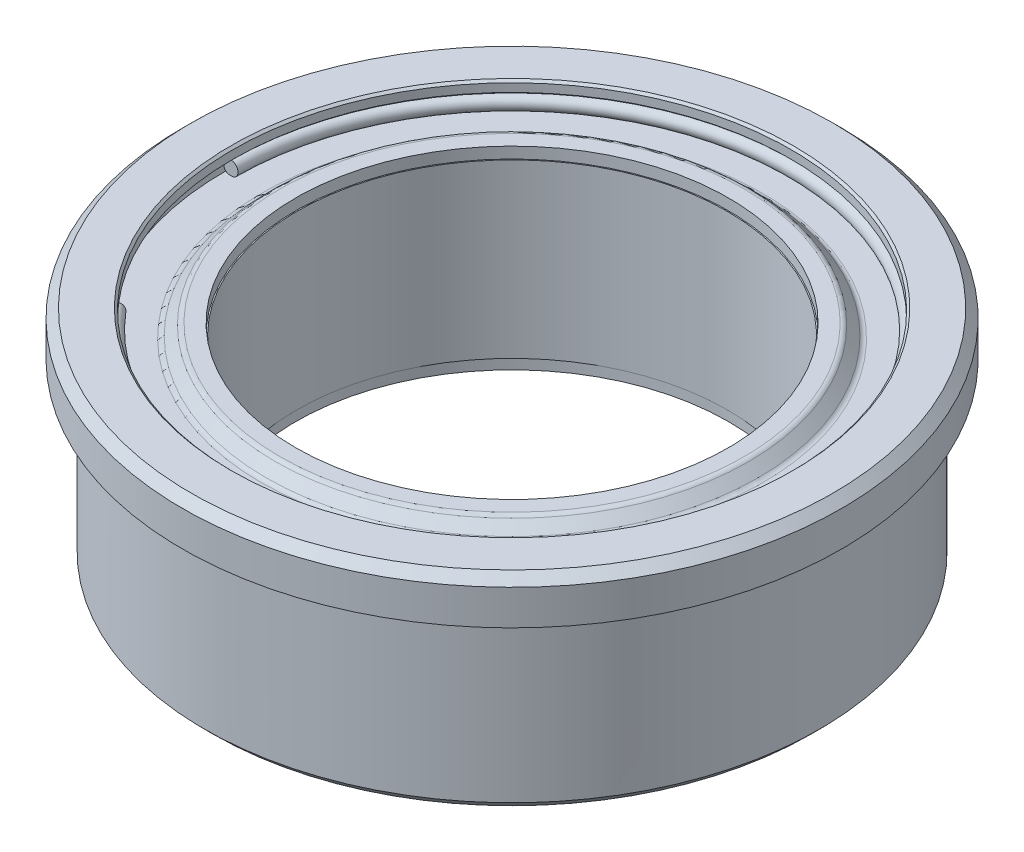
ISO-10303-21;
HEADER;
FILE_DESCRIPTION(('STEP AP214'),'2;1');
FILE_NAME('part.step','',(''),(''),'','','');
FILE_SCHEMA(('AUTOMOTIVE_DESIGN { 1 0 10303 214 1 1 1 1 }'));
ENDSEC;
DATA;
#1=APPLICATION_CONTEXT('core data for automotive mechanical design processes');
#2=APPLICATION_PROTOCOL_DEFINITION('international standard','automotive_design',2000,#1);
#3=PRODUCT_CONTEXT('',#1,'mechanical');
#4=PRODUCT('Part','Part','',(#3));
#5=PRODUCT_RELATED_PRODUCT_CATEGORY('part','',(#4));
#6=PRODUCT_DEFINITION_FORMATION('','',#4);
#7=PRODUCT_DEFINITION_CONTEXT('part definition',#1,'design');
#8=PRODUCT_DEFINITION('design','',#6,#7);
#9=PRODUCT_DEFINITION_SHAPE('','',#8);
#10=(LENGTH_UNIT() NAMED_UNIT(*) SI_UNIT(.MILLI.,.METRE.));
#11=(NAMED_UNIT(*) PLANE_ANGLE_UNIT() SI_UNIT($,.RADIAN.));
#12=(NAMED_UNIT(*) SI_UNIT($,.STERADIAN.) SOLID_ANGLE_UNIT());
#13=UNCERTAINTY_MEASURE_WITH_UNIT(LENGTH_MEASURE(1.E-05),#10,'distance_accuracy_value','');
#14=(GEOMETRIC_REPRESENTATION_CONTEXT(3) GLOBAL_UNCERTAINTY_ASSIGNED_CONTEXT((#13)) GLOBAL_UNIT_ASSIGNED_CONTEXT((#10,
#11,#12)) REPRESENTATION_CONTEXT('',''));
#15=CARTESIAN_POINT('',(0.,0.,0.));
#16=DIRECTION('',(0.,0.,1.));
#17=DIRECTION('',(1.,0.,0.));
#18=AXIS2_PLACEMENT_3D('',#15,#16,#17);
#19=CARTESIAN_POINT('',(0.,4.456,0.));
#20=DIRECTION('',(0.,1.,0.));
#21=DIRECTION('',(0.,0.,1.));
#22=AXIS2_PLACEMENT_3D('',#19,#20,#21);
#23=CYLINDRICAL_SURFACE('',#22,4.925);
#24=CARTESIAN_POINT('',(0.,4.456,0.));
#25=DIRECTION('',(0.,1.,0.));
#26=DIRECTION('',(0.,0.,1.));
#27=AXIS2_PLACEMENT_3D('',#24,#25,#26);
#28=CIRCLE('',#27,4.925);
#29=CARTESIAN_POINT('',(0.,4.456,4.925));
#30=VERTEX_POINT('',#29);
#31=EDGE_CURVE('E997',#30,#30,#28,.T.);
#32=ORIENTED_EDGE('',*,*,#31,.F.);
#33=EDGE_LOOP('',(#32));
#34=FACE_BOUND('',#33,.T.);
#35=CARTESIAN_POINT('',(0.,4.71,0.));
#36=DIRECTION('',(0.,1.,0.));
#37=DIRECTION('',(0.,0.,1.));
#38=AXIS2_PLACEMENT_3D('',#35,#36,#37);
#39=CIRCLE('',#38,4.925);
#40=CARTESIAN_POINT('',(0.,4.71,4.925));
#41=VERTEX_POINT('',#40);
#42=EDGE_CURVE('E1000',#41,#41,#39,.F.);
#43=ORIENTED_EDGE('',*,*,#42,.F.);
#44=EDGE_LOOP('',(#43));
#45=FACE_BOUND('',#44,.T.);
#46=ADVANCED_FACE('F16',(#34,#45),#23,.F.);
#47=CARTESIAN_POINT('',(0.,4.456,0.));
#48=DIRECTION('',(0.,1.,0.));
#49=DIRECTION('',(0.,0.,1.));
#50=AXIS2_PLACEMENT_3D('',#47,#48,#49);
#51=PLANE('',#50);
#52=CARTESIAN_POINT('',(0.,4.456,0.));
#53=DIRECTION('',(0.,-1.,0.));
#54=DIRECTION('',(0.,0.,-1.));
#55=AXIS2_PLACEMENT_3D('',#52,#53,#54);
#56=CIRCLE('',#55,4.9);
#57=CARTESIAN_POINT('',(0.,4.456,-4.9));
#58=VERTEX_POINT('',#57);
#59=EDGE_CURVE('E1001',#58,#58,#56,.T.);
#60=ORIENTED_EDGE('',*,*,#59,.T.);
#61=EDGE_LOOP('',(#60));
#62=FACE_BOUND('',#61,.T.);
#63=ORIENTED_EDGE('',*,*,#31,.T.);
#64=EDGE_LOOP('',(#63));
#65=FACE_BOUND('',#64,.T.);
#66=ADVANCED_FACE('F961',(#62,#65),#51,.T.);
#67=CARTESIAN_POINT('',(0.,4.71,0.));
#68=DIRECTION('',(0.,1.,0.));
#69=DIRECTION('',(0.,0.,1.));
#70=AXIS2_PLACEMENT_3D('',#67,#68,#69);
#71=PLANE('',#70);
#72=ORIENTED_EDGE('',*,*,#42,.T.);
#73=EDGE_LOOP('',(#72));
#74=FACE_BOUND('',#73,.T.);
#75=CARTESIAN_POINT('',(0.,4.71,0.));
#76=DIRECTION('',(0.,-1.,0.));
#77=DIRECTION('',(0.,0.,1.));
#78=AXIS2_PLACEMENT_3D('',#75,#76,#77);
#79=CIRCLE('',#78,5.27978129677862);
#80=CARTESIAN_POINT('',(0.,4.71,5.27978129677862));
#81=VERTEX_POINT('',#80);
#82=EDGE_CURVE('E1004',#81,#81,#79,.T.);
#83=ORIENTED_EDGE('',*,*,#82,.F.);
#84=EDGE_LOOP('',(#83));
#85=FACE_BOUND('',#84,.T.);
#86=ADVANCED_FACE('F953',(#74,#85),#71,.T.);
#87=CARTESIAN_POINT('',(0.,0.3,0.));
#88=DIRECTION('',(0.,-1.,0.));
#89=DIRECTION('',(0.,0.,-1.));
#90=AXIS2_PLACEMENT_3D('',#87,#88,#89);
#91=CYLINDRICAL_SURFACE('',#90,4.9);
#92=ORIENTED_EDGE('',*,*,#59,.F.);
#93=EDGE_LOOP('',(#92));
#94=FACE_BOUND('',#93,.T.);
#95=CARTESIAN_POINT('',(0.,0.544,0.));
#96=DIRECTION('',(0.,-1.,0.));
#97=DIRECTION('',(0.,0.,-1.));
#98=AXIS2_PLACEMENT_3D('',#95,#96,#97);
#99=CIRCLE('',#98,4.9);
#100=CARTESIAN_POINT('',(0.,0.544,-4.9));
#101=VERTEX_POINT('',#100);
#102=EDGE_CURVE('E290',#101,#101,#99,.F.);
#103=ORIENTED_EDGE('',*,*,#102,.F.);
#104=EDGE_LOOP('',(#103));
#105=FACE_BOUND('',#104,.T.);
#106=ADVANCED_FACE('F304',(#94,#105),#91,.F.);
#107=CARTESIAN_POINT('',(0.,4.56,0.));
#108=DIRECTION('',(0.,1.,0.));
#109=DIRECTION('',(0.,0.,1.));
#110=AXIS2_PLACEMENT_3D('',#107,#108,#109);
#111=TOROIDAL_SURFACE('',#110,5.27978129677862,0.15);
#112=CARTESIAN_POINT('',(0.,4.66606601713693,0.));
#113=DIRECTION('',(0.,-1.,0.));
#114=DIRECTION('',(0.,0.,-1.));
#115=AXIS2_PLACEMENT_3D('',#112,#113,#114);
#116=CIRCLE('',#115,5.38584731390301);
#117=CARTESIAN_POINT('',(0.,4.66606601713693,-5.38584731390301));
#118=VERTEX_POINT('',#117);
#119=EDGE_CURVE('E281',#118,#118,#116,.T.);
#120=ORIENTED_EDGE('',*,*,#119,.F.);
#121=EDGE_LOOP('',(#120));
#122=FACE_BOUND('',#121,.T.);
#123=ORIENTED_EDGE('',*,*,#82,.T.);
#124=EDGE_LOOP('',(#123));
#125=FACE_BOUND('',#124,.T.);
#126=ADVANCED_FACE('F298',(#122,#125),#111,.T.);
#127=CARTESIAN_POINT('',(0.,0.544,0.));
#128=DIRECTION('',(0.,-1.,0.));
#129=DIRECTION('',(0.,0.,-1.));
#130=AXIS2_PLACEMENT_3D('',#127,#128,#129);
#131=PLANE('',#130);
#132=ORIENTED_EDGE('',*,*,#102,.T.);
#133=EDGE_LOOP('',(#132));
#134=FACE_BOUND('',#133,.T.);
#135=CARTESIAN_POINT('',(0.,0.544,0.));
#136=DIRECTION('',(0.,-1.,0.));
#137=DIRECTION('',(0.,0.,-1.));
#138=AXIS2_PLACEMENT_3D('',#135,#136,#137);
#139=CIRCLE('',#138,4.925);
#140=CARTESIAN_POINT('',(0.,0.544,-4.925));
#141=VERTEX_POINT('',#140);
#142=EDGE_CURVE('E289',#141,#141,#139,.T.);
#143=ORIENTED_EDGE('',*,*,#142,.T.);
#144=EDGE_LOOP('',(#143));
#145=FACE_BOUND('',#144,.T.);
#146=ADVANCED_FACE('F303',(#134,#145),#131,.T.);
#147=CARTESIAN_POINT('',(0.,4.45393398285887,0.));
#148=DIRECTION('',(0.,-1.,0.));
#149=DIRECTION('',(0.,0.,-1.));
#150=AXIS2_PLACEMENT_3D('',#147,#148,#149);
#151=CONICAL_SURFACE('',#150,5.59797934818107,0.785398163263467);
#152=ORIENTED_EDGE('',*,*,#119,.T.);
#153=EDGE_LOOP('',(#152));
#154=FACE_BOUND('',#153,.T.);
#155=CARTESIAN_POINT('',(0.,4.45393398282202,0.));
#156=DIRECTION('',(0.,1.,0.));
#157=DIRECTION('',(0.,0.,1.));
#158=AXIS2_PLACEMENT_3D('',#155,#156,#157);
#159=CIRCLE('',#158,5.59797934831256);
#160=CARTESIAN_POINT('',(0.,4.45393398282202,5.59797934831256));
#161=VERTEX_POINT('',#160);
#162=EDGE_CURVE('E127',#161,#161,#159,.T.);
#163=ORIENTED_EDGE('',*,*,#162,.T.);
#164=EDGE_LOOP('',(#163));
#165=FACE_BOUND('',#164,.T.);
#166=ADVANCED_FACE('F926',(#154,#165),#151,.T.);
#167=CARTESIAN_POINT('',(0.,0.544,0.));
#168=DIRECTION('',(0.,-1.,0.));
#169=DIRECTION('',(0.,0.,-1.));
#170=AXIS2_PLACEMENT_3D('',#167,#168,#169);
#171=CYLINDRICAL_SURFACE('',#170,4.925);
#172=ORIENTED_EDGE('',*,*,#142,.F.);
#173=EDGE_LOOP('',(#172));
#174=FACE_BOUND('',#173,.T.);
#175=CARTESIAN_POINT('',(0.,0.3,0.));
#176=DIRECTION('',(0.,-1.,0.));
#177=DIRECTION('',(0.,0.,-1.));
#178=AXIS2_PLACEMENT_3D('',#175,#176,#177);
#179=CIRCLE('',#178,4.925);
#180=CARTESIAN_POINT('',(0.,0.3,-4.925));
#181=VERTEX_POINT('',#180);
#182=EDGE_CURVE('E144',#181,#181,#179,.F.);
#183=ORIENTED_EDGE('',*,*,#182,.F.);
#184=EDGE_LOOP('',(#183));
#185=FACE_BOUND('',#184,.T.);
#186=ADVANCED_FACE('F273',(#174,#185),#171,.F.);
#187=CARTESIAN_POINT('',(0.,4.56,0.));
#188=DIRECTION('',(0.,1.,0.));
#189=DIRECTION('',(0.,0.,1.));
#190=AXIS2_PLACEMENT_3D('',#187,#188,#189);
#191=TOROIDAL_SURFACE('',#190,5.70404536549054,0.15);
#192=ORIENTED_EDGE('',*,*,#162,.F.);
#193=EDGE_LOOP('',(#192));
#194=FACE_BOUND('',#193,.T.);
#195=CARTESIAN_POINT('',(0.,4.41,0.));
#196=DIRECTION('',(0.,1.,0.));
#197=DIRECTION('',(0.,0.,1.));
#198=AXIS2_PLACEMENT_3D('',#195,#196,#197);
#199=CIRCLE('',#198,5.70404536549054);
#200=CARTESIAN_POINT('',(0.,4.41,5.70404536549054));
#201=VERTEX_POINT('',#200);
#202=EDGE_CURVE('E141',#201,#201,#199,.F.);
#203=ORIENTED_EDGE('',*,*,#202,.F.);
#204=EDGE_LOOP('',(#203));
#205=FACE_BOUND('',#204,.T.);
#206=ADVANCED_FACE('F269',(#194,#205),#191,.F.);
#207=CARTESIAN_POINT('',(0.,4.56,0.));
#208=DIRECTION('',(0.,1.,0.));
#209=DIRECTION('',(0.,0.,1.));
#210=AXIS2_PLACEMENT_3D('',#207,#208,#209);
#211=TOROIDAL_SURFACE('',#210,6.4,0.1627);
#212=CARTESIAN_POINT('',(-6.46301817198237,4.41,0.));
#213=CARTESIAN_POINT('',(-6.47145305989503,4.41353499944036,0.));
#214=CARTESIAN_POINT('',(-6.47958132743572,4.41779434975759,0.));
#215=CARTESIAN_POINT('',(-6.49501894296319,4.42761521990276,0.));
#216=CARTESIAN_POINT('',(-6.50232760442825,4.43317781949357,0.));
#217=CARTESIAN_POINT('',(-6.51591014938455,4.44545639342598,0.));
#218=CARTESIAN_POINT('',(-6.52218333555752,4.45217313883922,0.));
#219=CARTESIAN_POINT('',(-6.53349960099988,4.46655242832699,0.));
#220=CARTESIAN_POINT('',(-6.53854532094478,4.474212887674,0.));
#221=CARTESIAN_POINT('',(-6.54552246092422,4.48703016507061,0.));
#222=CARTESIAN_POINT('',(-6.54788991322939,4.49195352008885,0.));
#223=CARTESIAN_POINT('',(-6.55,4.49698182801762,0.));
#224=B_SPLINE_CURVE_WITH_KNOTS('',3,(#212,#213,#214,#215,#216,#217,#218,#219,#220,#221,#222,
#223),.UNSPECIFIED.,.F.,.F.,(4,2,2,2,2,4),(0.,0.0274010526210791,0.0548248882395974,
0.0822671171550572,0.109649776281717,0.126009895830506),.UNSPECIFIED.);
#225=CARTESIAN_POINT('',(-6.46301817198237,4.41,0.));
#226=VERTEX_POINT('',#225);
#227=CARTESIAN_POINT('',(-6.55,4.49698182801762,0.));
#228=VERTEX_POINT('',#227);
#229=EDGE_CURVE('E126',#226,#228,#224,.T.);
#230=ORIENTED_EDGE('',*,*,#229,.T.);
#231=CARTESIAN_POINT('',(0.,4.49698182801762,0.));
#232=DIRECTION('',(0.,1.,0.));
#233=DIRECTION('',(0.,0.,1.));
#234=AXIS2_PLACEMENT_3D('',#231,#232,#233);
#235=CIRCLE('',#234,6.55);
#236=CARTESIAN_POINT('',(-5.01759110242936,4.49698182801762,4.21025884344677));
#237=VERTEX_POINT('',#236);
#238=EDGE_CURVE('E124',#228,#237,#235,.F.);
#239=ORIENTED_EDGE('',*,*,#238,.T.);
#240=CARTESIAN_POINT('',(-5.01759110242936,4.49698182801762,4.21025884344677));
#241=CARTESIAN_POINT('',(-5.01488313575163,4.48854694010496,4.20798658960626));
#242=CARTESIAN_POINT('',(-5.01162028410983,4.48041867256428,4.20524873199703));
#243=CARTESIAN_POINT('',(-5.00409706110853,4.46498105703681,4.19893599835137));
#244=CARTESIAN_POINT('',(-4.9998358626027,4.45767239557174,4.19536042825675));
#245=CARTESIAN_POINT('',(-4.99042992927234,4.44408985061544,4.18746791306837));
#246=CARTESIAN_POINT('',(-4.98528460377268,4.43781666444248,4.18315047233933));
#247=CARTESIAN_POINT('',(-4.97426942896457,4.42650039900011,4.17390764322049));
#248=CARTESIAN_POINT('',(-4.96840117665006,4.42145467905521,4.16898359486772));
#249=CARTESIAN_POINT('',(-4.95858257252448,4.41447753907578,4.16074480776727));
#250=CARTESIAN_POINT('',(-4.95481106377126,4.41211008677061,4.15758013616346));
#251=CARTESIAN_POINT('',(-4.95095915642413,4.41,4.15434800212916));
#252=B_SPLINE_CURVE_WITH_KNOTS('',3,(#240,#241,#242,#243,#244,#245,#246,#247,#248,#249,#250,
#251),.UNSPECIFIED.,.F.,.F.,(4,2,2,2,2,4),(0.,0.0274010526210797,0.054824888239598,
0.0822671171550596,0.10964977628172,0.1260098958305),.UNSPECIFIED.);
#253=CARTESIAN_POINT('',(-4.95095915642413,4.41,4.15434800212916));
#254=VERTEX_POINT('',#253);
#255=EDGE_CURVE('E115',#237,#254,#252,.T.);
#256=ORIENTED_EDGE('',*,*,#255,.T.);
#257=CARTESIAN_POINT('',(0.,4.41,0.));
#258=DIRECTION('',(0.,1.,0.));
#259=DIRECTION('',(0.,0.,1.));
#260=AXIS2_PLACEMENT_3D('',#257,#258,#259);
#261=CIRCLE('',#260,6.46301817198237);
#262=EDGE_CURVE('E121',#226,#254,#261,.F.);
#263=ORIENTED_EDGE('',*,*,#262,.F.);
#264=EDGE_LOOP('',(#230,#239,#256,#263));
#265=FACE_BOUND('',#264,.T.);
#266=ADVANCED_FACE('F119',(#265),#211,.T.);
#267=CARTESIAN_POINT('',(0.,0.3,0.));
#268=DIRECTION('',(0.,-1.,0.));
#269=DIRECTION('',(0.,0.,-1.));
#270=AXIS2_PLACEMENT_3D('',#267,#268,#269);
#271=PLANE('',#270);
#272=CARTESIAN_POINT('',(0.,0.3,0.));
#273=DIRECTION('',(0.,1.,0.));
#274=DIRECTION('',(0.,0.,-1.));
#275=AXIS2_PLACEMENT_3D('',#272,#273,#274);
#276=CIRCLE('',#275,5.27978129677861);
#277=CARTESIAN_POINT('',(0.,0.3,-5.27978129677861));
#278=VERTEX_POINT('',#277);
#279=EDGE_CURVE('E220',#278,#278,#276,.T.);
#280=ORIENTED_EDGE('',*,*,#279,.F.);
#281=EDGE_LOOP('',(#280));
#282=FACE_BOUND('',#281,.T.);
#283=ORIENTED_EDGE('',*,*,#182,.T.);
#284=EDGE_LOOP('',(#283));
#285=FACE_BOUND('',#284,.T.);
#286=ADVANCED_FACE('F235',(#282,#285),#271,.T.);
#287=CARTESIAN_POINT('',(0.,4.41,0.));
#288=DIRECTION('',(0.,1.,0.));
#289=DIRECTION('',(0.,0.,1.));
#290=AXIS2_PLACEMENT_3D('',#287,#288,#289);
#291=PLANE('',#290);
#292=CARTESIAN_POINT('',(0.,4.41,0.));
#293=DIRECTION('',(0.,1.,0.));
#294=DIRECTION('',(0.,0.,1.));
#295=AXIS2_PLACEMENT_3D('',#292,#293,#294);
#296=CIRCLE('',#295,6.33698182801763);
#297=CARTESIAN_POINT('',(-6.33698182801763,4.41,0.));
#298=VERTEX_POINT('',#297);
#299=CARTESIAN_POINT('',(-4.8544097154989,4.41,4.07333340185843));
#300=VERTEX_POINT('',#299);
#301=EDGE_CURVE('E534',#298,#300,#296,.F.);
#302=ORIENTED_EDGE('',*,*,#301,.F.);
#303=DIRECTION('',(1.,0.,0.));
#304=VECTOR('',#303,1.);
#305=CARTESIAN_POINT('',(0.,4.41,0.));
#306=LINE('',#305,#304);
#307=EDGE_CURVE('E137',#298,#226,#306,.F.);
#308=ORIENTED_EDGE('',*,*,#307,.T.);
#309=ORIENTED_EDGE('',*,*,#262,.T.);
#310=DIRECTION('',(0.766044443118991,0.,-0.642787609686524));
#311=VECTOR('',#310,1.);
#312=CARTESIAN_POINT('',(-4.95095915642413,4.41,4.15434800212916));
#313=LINE('',#312,#311);
#314=EDGE_CURVE('E130',#254,#300,#313,.T.);
#315=ORIENTED_EDGE('',*,*,#314,.T.);
#316=EDGE_LOOP('',(#302,#308,#309,#315));
#317=FACE_BOUND('',#316,.T.);
#318=CARTESIAN_POINT('',(0.,4.41,0.));
#319=DIRECTION('',(0.,1.,0.));
#320=DIRECTION('',(0.,0.,1.));
#321=AXIS2_PLACEMENT_3D('',#318,#319,#320);
#322=CIRCLE('',#321,6.55);
#323=CARTESIAN_POINT('',(0.,4.41,6.55));
#324=VERTEX_POINT('',#323);
#325=EDGE_CURVE('E262',#324,#324,#322,.T.);
#326=ORIENTED_EDGE('',*,*,#325,.T.);
#327=EDGE_LOOP('',(#326));
#328=FACE_BOUND('',#327,.T.);
#329=ORIENTED_EDGE('',*,*,#202,.T.);
#330=EDGE_LOOP('',(#329));
#331=FACE_BOUND('',#330,.T.);
#332=ADVANCED_FACE('F139',(#317,#328,#331),#291,.T.);
#333=CARTESIAN_POINT('',(0.,4.41,0.));
#334=DIRECTION('',(0.,1.,0.));
#335=DIRECTION('',(0.,0.,1.));
#336=AXIS2_PLACEMENT_3D('',#333,#334,#335);
#337=CYLINDRICAL_SURFACE('',#336,6.55);
#338=ORIENTED_EDGE('',*,*,#325,.F.);
#339=EDGE_LOOP('',(#338));
#340=FACE_BOUND('',#339,.T.);
#341=CARTESIAN_POINT('',(0.,4.71,0.));
#342=DIRECTION('',(0.,1.,0.));
#343=DIRECTION('',(0.,0.,1.));
#344=AXIS2_PLACEMENT_3D('',#341,#342,#343);
#345=CIRCLE('',#344,6.55);
#346=CARTESIAN_POINT('',(0.,4.71,6.55));
#347=VERTEX_POINT('',#346);
#348=EDGE_CURVE('E507',#347,#347,#345,.T.);
#349=ORIENTED_EDGE('',*,*,#348,.T.);
#350=EDGE_LOOP('',(#349));
#351=FACE_BOUND('',#350,.T.);
#352=CARTESIAN_POINT('',(0.,4.62301817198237,0.));
#353=DIRECTION('',(0.,1.,0.));
#354=DIRECTION('',(0.,0.,1.));
#355=AXIS2_PLACEMENT_3D('',#352,#353,#354);
#356=CIRCLE('',#355,6.55);
#357=CARTESIAN_POINT('',(-5.01759110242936,4.62301817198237,4.21025884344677));
#358=VERTEX_POINT('',#357);
#359=CARTESIAN_POINT('',(-6.55,4.62301817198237,0.));
#360=VERTEX_POINT('',#359);
#361=EDGE_CURVE('E218',#358,#360,#356,.T.);
#362=ORIENTED_EDGE('',*,*,#361,.F.);
#363=DIRECTION('',(0.,1.,0.));
#364=VECTOR('',#363,1.);
#365=CARTESIAN_POINT('',(-5.01759110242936,4.41,4.21025884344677));
#366=LINE('',#365,#364);
#367=EDGE_CURVE('E217',#237,#358,#366,.T.);
#368=ORIENTED_EDGE('',*,*,#367,.F.);
#369=ORIENTED_EDGE('',*,*,#238,.F.);
#370=DIRECTION('',(0.,1.,0.));
#371=VECTOR('',#370,1.);
#372=CARTESIAN_POINT('',(-6.55,0.,0.));
#373=LINE('',#372,#371);
#374=EDGE_CURVE('E198',#360,#228,#373,.F.);
#375=ORIENTED_EDGE('',*,*,#374,.F.);
#376=EDGE_LOOP('',(#362,#368,#369,#375));
#377=FACE_BOUND('',#376,.T.);
#378=ADVANCED_FACE('F207',(#340,#351,#377),#337,.F.);
#379=CARTESIAN_POINT('',(0.,4.56,0.));
#380=DIRECTION('',(0.,1.,0.));
#381=DIRECTION('',(0.,0.,1.));
#382=AXIS2_PLACEMENT_3D('',#379,#380,#381);
#383=TOROIDAL_SURFACE('',#382,6.4,0.1627);
#384=ORIENTED_EDGE('',*,*,#361,.T.);
#385=CARTESIAN_POINT('',(-6.46301817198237,4.71,0.));
#386=CARTESIAN_POINT('',(-6.47145305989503,4.70646500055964,0.));
#387=CARTESIAN_POINT('',(-6.47958132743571,4.70220565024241,0.));
#388=CARTESIAN_POINT('',(-6.49501894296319,4.69238478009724,0.));
#389=CARTESIAN_POINT('',(-6.50232760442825,4.68682218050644,0.));
#390=CARTESIAN_POINT('',(-6.51591014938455,4.67454360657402,0.));
#391=CARTESIAN_POINT('',(-6.52218333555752,4.66782686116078,0.));
#392=CARTESIAN_POINT('',(-6.53349960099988,4.65344757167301,0.));
#393=CARTESIAN_POINT('',(-6.53854532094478,4.645787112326,0.));
#394=CARTESIAN_POINT('',(-6.54552246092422,4.63296983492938,0.));
#395=CARTESIAN_POINT('',(-6.54788991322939,4.62804647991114,0.));
#396=CARTESIAN_POINT('',(-6.55,4.62301817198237,0.));
#397=B_SPLINE_CURVE_WITH_KNOTS('',3,(#385,#386,#387,#388,#389,#390,#391,#392,#393,#394,#395,
#396),.UNSPECIFIED.,.F.,.F.,(4,2,2,2,2,4),(0.,0.0274010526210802,0.0548248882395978,
0.0822671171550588,0.109649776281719,0.12600989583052),.UNSPECIFIED.);
#398=CARTESIAN_POINT('',(-6.46301817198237,4.71,0.));
#399=VERTEX_POINT('',#398);
#400=EDGE_CURVE('E190',#399,#360,#397,.T.);
#401=ORIENTED_EDGE('',*,*,#400,.F.);
#402=CARTESIAN_POINT('',(0.,4.71,0.));
#403=DIRECTION('',(0.,1.,0.));
#404=DIRECTION('',(0.,0.,1.));
#405=AXIS2_PLACEMENT_3D('',#402,#403,#404);
#406=CIRCLE('',#405,6.46301817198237);
#407=CARTESIAN_POINT('',(-4.95095915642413,4.71,4.15434800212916));
#408=VERTEX_POINT('',#407);
#409=EDGE_CURVE('E506',#399,#408,#406,.F.);
#410=ORIENTED_EDGE('',*,*,#409,.T.);
#411=CARTESIAN_POINT('',(-4.95095915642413,4.71,4.15434800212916));
#412=CARTESIAN_POINT('',(-4.95742065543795,4.70646500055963,4.15976984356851));
#413=CARTESIAN_POINT('',(-4.96364726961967,4.70220565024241,4.16499459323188));
#414=CARTESIAN_POINT('',(-4.9754731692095,4.69238478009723,4.17491770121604));
#415=CARTESIAN_POINT('',(-4.98107192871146,4.68682218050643,4.17961561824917));
#416=CARTESIAN_POINT('',(-4.99147676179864,4.67454360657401,4.18834630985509));
#417=CARTESIAN_POINT('',(-4.99628230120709,4.66782686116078,4.19237863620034));
#418=CARTESIAN_POINT('',(-5.00495106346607,4.653447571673,4.19965259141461));
#419=CARTESIAN_POINT('',(-5.0088163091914,4.64578711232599,4.20289591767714));
#420=CARTESIAN_POINT('',(-5.01416110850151,4.63296983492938,4.20738073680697));
#421=CARTESIAN_POINT('',(-5.01597468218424,4.62804647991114,4.20890250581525));
#422=CARTESIAN_POINT('',(-5.01759110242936,4.62301817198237,4.21025884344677));
#423=B_SPLINE_CURVE_WITH_KNOTS('',3,(#411,#412,#413,#414,#415,#416,#417,#418,#419,#420,#421,
#422),.UNSPECIFIED.,.F.,.F.,(4,2,2,2,2,4),(0.,0.0274010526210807,0.0548248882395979,
0.0822671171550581,0.109649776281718,0.126009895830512),.UNSPECIFIED.);
#424=EDGE_CURVE('E221',#408,#358,#423,.T.);
#425=ORIENTED_EDGE('',*,*,#424,.T.);
#426=EDGE_LOOP('',(#384,#401,#410,#425));
#427=FACE_BOUND('',#426,.T.);
#428=ADVANCED_FACE('F201',(#427),#383,.T.);
#429=CARTESIAN_POINT('',(0.,0.45,0.));
#430=DIRECTION('',(0.,-1.,0.));
#431=DIRECTION('',(0.,0.,-1.));
#432=AXIS2_PLACEMENT_3D('',#429,#430,#431);
#433=TOROIDAL_SURFACE('',#432,5.27978129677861,0.15);
#434=CARTESIAN_POINT('',(0.,0.343933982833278,0.));
#435=DIRECTION('',(0.,1.,0.));
#436=DIRECTION('',(0.,0.,1.));
#437=AXIS2_PLACEMENT_3D('',#434,#435,#436);
#438=CIRCLE('',#437,5.38584731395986);
#439=CARTESIAN_POINT('',(0.,0.343933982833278,5.38584731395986));
#440=VERTEX_POINT('',#439);
#441=EDGE_CURVE('E485',#440,#440,#438,.T.);
#442=ORIENTED_EDGE('',*,*,#441,.F.);
#443=EDGE_LOOP('',(#442));
#444=FACE_BOUND('',#443,.T.);
#445=ORIENTED_EDGE('',*,*,#279,.T.);
#446=EDGE_LOOP('',(#445));
#447=FACE_BOUND('',#446,.T.);
#448=ADVANCED_FACE('F206',(#444,#447),#433,.T.);
#449=CARTESIAN_POINT('',(0.,4.56,0.));
#450=DIRECTION('',(0.,1.,0.));
#451=DIRECTION('',(0.,0.,1.));
#452=AXIS2_PLACEMENT_3D('',#449,#450,#451);
#453=TOROIDAL_SURFACE('',#452,6.4,0.1627);
#454=CARTESIAN_POINT('',(-4.8544097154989,4.41,4.07333340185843));
#455=CARTESIAN_POINT('',(-4.84794304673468,4.41353890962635,4.06790722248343));
#456=CARTESIAN_POINT('',(-4.84171179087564,4.41780159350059,4.06267857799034));
#457=CARTESIAN_POINT('',(-4.82988697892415,4.42762335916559,4.0527563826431));
#458=CARTESIAN_POINT('',(-4.82429296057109,4.4331814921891,4.04806244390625));
#459=CARTESIAN_POINT('',(-4.81389716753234,4.44545145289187,4.03933933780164));
#460=CARTESIAN_POINT('',(-4.8090957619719,4.45216381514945,4.03531048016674));
#461=CARTESIAN_POINT('',(-4.80042580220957,4.46653326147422,4.02803552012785));
#462=CARTESIAN_POINT('',(-4.79655706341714,4.47419015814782,4.024789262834));
#463=CARTESIAN_POINT('',(-4.78652930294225,4.49827329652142,4.01637497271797));
#464=CARTESIAN_POINT('',(-4.78191127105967,4.51585685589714,4.01249998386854));
#465=CARTESIAN_POINT('',(-4.77740877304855,4.55199319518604,4.00872193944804));
#466=CARTESIAN_POINT('',(-4.77752430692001,4.57054597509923,4.00881888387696));
#467=CARTESIAN_POINT('',(-4.78244240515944,4.60656081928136,4.01294565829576));
#468=CARTESIAN_POINT('',(-4.78724496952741,4.6240228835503,4.01697548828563));
#469=CARTESIAN_POINT('',(-4.80103564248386,4.6559022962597,4.02854723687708));
#470=CARTESIAN_POINT('',(-4.81002375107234,4.67031964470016,4.03608915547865));
#471=CARTESIAN_POINT('',(-4.82580895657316,4.68839645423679,4.04933451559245));
#472=CARTESIAN_POINT('',(-4.83146656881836,4.69383697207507,4.05408181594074));
#473=CARTESIAN_POINT('',(-4.84340662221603,4.70341026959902,4.06410071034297));
#474=CARTESIAN_POINT('',(-4.8496890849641,4.70754300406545,4.06937232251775));
#475=CARTESIAN_POINT('',(-4.86210857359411,4.71406195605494,4.07979351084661));
#476=CARTESIAN_POINT('',(-4.86820792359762,4.71657175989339,4.08491147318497));
#477=CARTESIAN_POINT('',(-4.88062786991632,4.72034922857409,4.09533304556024));
#478=CARTESIAN_POINT('',(-4.88694845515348,4.72161695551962,4.10063664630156));
#479=CARTESIAN_POINT('',(-4.89330880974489,4.72223901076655,4.10597361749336));
#480=B_SPLINE_CURVE_WITH_KNOTS('',3,(#454,#455,#456,#457,#458,#459,#460,#461,#462,#463,#464,
#465,#466,#467,#468,#469,#470,#471,#472,#473,#474,#475,#476,#477,#478,#479),.UNSPECIFIED.,.F.,
.F.,(4,2,2,2,2,2,2,2,2,2,2,2,4),(0.,0.0274224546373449,0.0548248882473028,0.0822400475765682,
0.109649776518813,0.164279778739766,0.218909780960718,0.27353978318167,0.328169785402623,
0.355581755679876,0.382994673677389,0.40794384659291,0.432891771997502),.UNSPECIFIED.);
#481=CARTESIAN_POINT('',(-4.89330880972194,4.72223901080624,4.1059736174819));
#482=VERTEX_POINT('',#481);
#483=EDGE_CURVE('E133',#300,#482,#480,.T.);
#484=ORIENTED_EDGE('',*,*,#483,.T.);
#485=CARTESIAN_POINT('',(0.,4.72223901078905,0.));
#486=DIRECTION('',(0.,-1.,0.));
#487=DIRECTION('',(0.,0.,-1.));
#488=AXIS2_PLACEMENT_3D('',#485,#486,#487);
#489=CIRCLE('',#488,6.38776098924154);
#490=CARTESIAN_POINT('',(-6.38776098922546,4.72223901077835,0.));
#491=VERTEX_POINT('',#490);
#492=EDGE_CURVE('E493',#482,#491,#489,.F.);
#493=ORIENTED_EDGE('',*,*,#492,.T.);
#494=CARTESIAN_POINT('',(-6.33698182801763,4.41,0.));
#495=CARTESIAN_POINT('',(-6.32854019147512,4.41353890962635,0.));
#496=CARTESIAN_POINT('',(-6.32040586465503,4.41780159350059,0.));
#497=CARTESIAN_POINT('',(-6.30496966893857,4.42762335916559,0.));
#498=CARTESIAN_POINT('',(-6.29766719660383,4.4331814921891,0.));
#499=CARTESIAN_POINT('',(-6.28409645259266,4.44545145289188,0.));
#500=CARTESIAN_POINT('',(-6.27782866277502,4.45216381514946,0.));
#501=CARTESIAN_POINT('',(-6.26651083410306,4.46653326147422,0.));
#502=CARTESIAN_POINT('',(-6.2614605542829,4.47419015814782,0.));
#503=CARTESIAN_POINT('',(-6.24837024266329,4.49827329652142,0.));
#504=CARTESIAN_POINT('',(-6.24234183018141,4.51585685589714,0.));
#505=CARTESIAN_POINT('',(-6.23646423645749,4.55199319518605,0.));
#506=CARTESIAN_POINT('',(-6.23661505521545,4.57054597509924,0.));
#507=CARTESIAN_POINT('',(-6.24303517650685,4.60656081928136,0.));
#508=CARTESIAN_POINT('',(-6.24930447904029,4.6240228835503,0.));
#509=CARTESIAN_POINT('',(-6.26730692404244,4.6559022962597,0.));
#510=CARTESIAN_POINT('',(-6.27904006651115,4.67031964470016,0.));
#511=CARTESIAN_POINT('',(-6.29964618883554,4.68839645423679,0.));
#512=CARTESIAN_POINT('',(-6.30703167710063,4.69383697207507,0.));
#513=CARTESIAN_POINT('',(-6.32261830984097,4.70341026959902,0.));
#514=CARTESIAN_POINT('',(-6.33081948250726,4.70754300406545,0.));
#515=CARTESIAN_POINT('',(-6.34703197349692,4.71406195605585,0.));
#516=CARTESIAN_POINT('',(-6.35499410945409,4.71657175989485,0.));
#517=CARTESIAN_POINT('',(-6.37120719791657,4.72034922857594,0.));
#518=CARTESIAN_POINT('',(-6.37945813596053,4.72161695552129,0.));
#519=CARTESIAN_POINT('',(-6.38776098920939,4.72223901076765,0.));
#520=B_SPLINE_CURVE_WITH_KNOTS('',3,(#494,#495,#496,#497,#498,#499,#500,#501,#502,#503,#504,
#505,#506,#507,#508,#509,#510,#511,#512,#513,#514,#515,#516,#517,#518,#519),.UNSPECIFIED.,.F.,
.F.,(4,2,2,2,2,2,2,2,2,2,2,2,4),(0.,0.0274224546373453,0.0548248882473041,0.0822400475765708,
0.109649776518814,0.164279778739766,0.218909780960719,0.273539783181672,0.328169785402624,
0.355581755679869,0.382994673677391,0.407943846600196,0.432891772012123),.UNSPECIFIED.);
#521=EDGE_CURVE('E183',#298,#491,#520,.T.);
#522=ORIENTED_EDGE('',*,*,#521,.F.);
#523=ORIENTED_EDGE('',*,*,#301,.T.);
#524=EDGE_LOOP('',(#484,#493,#522,#523));
#525=FACE_BOUND('',#524,.T.);
#526=ADVANCED_FACE('F175',(#525),#453,.T.);
#527=CARTESIAN_POINT('',(0.,0.,0.));
#528=DIRECTION('',(0.,0.,1.));
#529=DIRECTION('',(1.,0.,0.));
#530=AXIS2_PLACEMENT_3D('',#527,#528,#529);
#531=PLANE('',#530);
#532=ORIENTED_EDGE('',*,*,#400,.T.);
#533=ORIENTED_EDGE('',*,*,#374,.T.);
#534=ORIENTED_EDGE('',*,*,#229,.F.);
#535=ORIENTED_EDGE('',*,*,#307,.F.);
#536=ORIENTED_EDGE('',*,*,#521,.T.);
#537=DIRECTION('',(0.707106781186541,0.707106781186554,0.));
#538=VECTOR('',#537,1.);
#539=CARTESIAN_POINT('',(-499000.,-498988.890000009,9.16648129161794E-11));
#540=LINE('',#539,#538);
#541=CARTESIAN_POINT('',(-6.39999999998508,4.7099999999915,0.));
#542=VERTEX_POINT('',#541);
#543=EDGE_CURVE('E500',#491,#542,#540,.F.);
#544=ORIENTED_EDGE('',*,*,#543,.T.);
#545=DIRECTION('',(1.,0.,0.));
#546=VECTOR('',#545,1.);
#547=CARTESIAN_POINT('',(0.,4.71,0.));
#548=LINE('',#547,#546);
#549=EDGE_CURVE('E503',#542,#399,#548,.F.);
#550=ORIENTED_EDGE('',*,*,#549,.T.);
#551=EDGE_LOOP('',(#532,#533,#534,#535,#536,#544,#550));
#552=FACE_BOUND('',#551,.T.);
#553=ADVANCED_FACE('F169',(#552),#531,.T.);
#554=CARTESIAN_POINT('',(0.,4.71,0.));
#555=DIRECTION('',(0.,1.,0.));
#556=DIRECTION('',(0.,0.,1.));
#557=AXIS2_PLACEMENT_3D('',#554,#555,#556);
#558=PLANE('',#557);
#559=ORIENTED_EDGE('',*,*,#409,.F.);
#560=ORIENTED_EDGE('',*,*,#549,.F.);
#561=CARTESIAN_POINT('',(0.,4.70999999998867,0.));
#562=DIRECTION('',(0.,-1.,0.));
#563=DIRECTION('',(0.,0.,-1.));
#564=AXIS2_PLACEMENT_3D('',#561,#562,#563);
#565=CIRCLE('',#564,6.39999999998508);
#566=CARTESIAN_POINT('',(-4.90268443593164,4.71000000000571,4.11384070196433));
#567=VERTEX_POINT('',#566);
#568=EDGE_CURVE('E502',#542,#567,#565,.F.);
#569=ORIENTED_EDGE('',*,*,#568,.T.);
#570=DIRECTION('',(0.766044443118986,0.,-0.64278760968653));
#571=VECTOR('',#570,1.);
#572=CARTESIAN_POINT('',(0.,4.71,0.));
#573=LINE('',#572,#571);
#574=EDGE_CURVE('E494',#567,#408,#573,.F.);
#575=ORIENTED_EDGE('',*,*,#574,.T.);
#576=EDGE_LOOP('',(#559,#560,#569,#575));
#577=FACE_BOUND('',#576,.T.);
#578=ORIENTED_EDGE('',*,*,#348,.F.);
#579=EDGE_LOOP('',(#578));
#580=FACE_BOUND('',#579,.T.);
#581=ADVANCED_FACE('F174',(#577,#580),#558,.F.);
#582=CARTESIAN_POINT('',(0.,0.,0.));
#583=DIRECTION('',(0.64278760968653,0.,0.766044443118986));
#584=DIRECTION('',(0.766044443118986,0.,-0.64278760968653));
#585=AXIS2_PLACEMENT_3D('',#582,#583,#584);
#586=PLANE('',#585);
#587=ORIENTED_EDGE('',*,*,#255,.F.);
#588=ORIENTED_EDGE('',*,*,#367,.T.);
#589=ORIENTED_EDGE('',*,*,#424,.F.);
#590=ORIENTED_EDGE('',*,*,#574,.F.);
#591=DIRECTION('',(0.541675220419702,0.707106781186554,-0.454519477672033));
#592=VECTOR('',#591,1.);
#593=CARTESIAN_POINT('',(-382256.177116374,-498988.890000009,320751.017233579));
#594=LINE('',#593,#592);
#595=EDGE_CURVE('E475',#567,#482,#594,.T.);
#596=ORIENTED_EDGE('',*,*,#595,.T.);
#597=ORIENTED_EDGE('',*,*,#483,.F.);
#598=ORIENTED_EDGE('',*,*,#314,.F.);
#599=EDGE_LOOP('',(#587,#588,#589,#590,#596,#597,#598));
#600=FACE_BOUND('',#599,.T.);
#601=ADVANCED_FACE('F131',(#600),#586,.F.);
#602=CARTESIAN_POINT('',(0.,0.546066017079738,0.));
#603=DIRECTION('',(0.,1.,0.));
#604=DIRECTION('',(0.,0.,1.));
#605=AXIS2_PLACEMENT_3D('',#602,#603,#604);
#606=CONICAL_SURFACE('',#605,5.58797934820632,0.785398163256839);
#607=ORIENTED_EDGE('',*,*,#441,.T.);
#608=EDGE_LOOP('',(#607));
#609=FACE_BOUND('',#608,.T.);
#610=CARTESIAN_POINT('',(0.,0.546066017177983,0.));
#611=DIRECTION('',(0.,-1.,0.));
#612=DIRECTION('',(0.,0.,-1.));
#613=AXIS2_PLACEMENT_3D('',#610,#611,#612);
#614=CIRCLE('',#613,5.58797934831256);
#615=CARTESIAN_POINT('',(0.,0.546066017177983,-5.58797934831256));
#616=VERTEX_POINT('',#615);
#617=EDGE_CURVE('E472',#616,#616,#614,.T.);
#618=ORIENTED_EDGE('',*,*,#617,.T.);
#619=EDGE_LOOP('',(#618));
#620=FACE_BOUND('',#619,.T.);
#621=ADVANCED_FACE('F525',(#609,#620),#606,.T.);
#622=CARTESIAN_POINT('',(0.,4.71000000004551,0.));
#623=DIRECTION('',(0.,-1.,0.));
#624=DIRECTION('',(0.,0.,-1.));
#625=AXIS2_PLACEMENT_3D('',#622,#623,#624);
#626=CONICAL_SURFACE('',#625,6.39999999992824,0.785398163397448);
#627=ORIENTED_EDGE('',*,*,#568,.F.);
#628=ORIENTED_EDGE('',*,*,#543,.F.);
#629=ORIENTED_EDGE('',*,*,#492,.F.);
#630=ORIENTED_EDGE('',*,*,#595,.F.);
#631=EDGE_LOOP('',(#627,#628,#629,#630));
#632=FACE_BOUND('',#631,.T.);
#633=CARTESIAN_POINT('',(0.,4.76,0.));
#634=DIRECTION('',(0.,1.,0.));
#635=DIRECTION('',(0.,0.,1.));
#636=AXIS2_PLACEMENT_3D('',#633,#634,#635);
#637=CIRCLE('',#636,6.35);
#638=CARTESIAN_POINT('',(0.,4.76,6.35));
#639=VERTEX_POINT('',#638);
#640=EDGE_CURVE('E440',#639,#639,#637,.T.);
#641=ORIENTED_EDGE('',*,*,#640,.T.);
#642=EDGE_LOOP('',(#641));
#643=FACE_BOUND('',#642,.T.);
#644=ADVANCED_FACE('F548',(#632,#643),#626,.F.);
#645=CARTESIAN_POINT('',(0.,0.44,0.));
#646=DIRECTION('',(0.,-1.,0.));
#647=DIRECTION('',(0.,0.,-1.));
#648=AXIS2_PLACEMENT_3D('',#645,#646,#647);
#649=TOROIDAL_SURFACE('',#648,5.69404536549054,0.15);
#650=ORIENTED_EDGE('',*,*,#617,.F.);
#651=EDGE_LOOP('',(#650));
#652=FACE_BOUND('',#651,.T.);
#653=CARTESIAN_POINT('',(0.,0.59,0.));
#654=DIRECTION('',(0.,-1.,0.));
#655=DIRECTION('',(0.,0.,-1.));
#656=AXIS2_PLACEMENT_3D('',#653,#654,#655);
#657=CIRCLE('',#656,5.69404536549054);
#658=CARTESIAN_POINT('',(0.,0.59,-5.69404536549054));
#659=VERTEX_POINT('',#658);
#660=EDGE_CURVE('E433',#659,#659,#657,.F.);
#661=ORIENTED_EDGE('',*,*,#660,.F.);
#662=EDGE_LOOP('',(#661));
#663=FACE_BOUND('',#662,.T.);
#664=ADVANCED_FACE('F460',(#652,#663),#649,.F.);
#665=CARTESIAN_POINT('',(0.,0.44,0.));
#666=DIRECTION('',(0.,-1.,0.));
#667=DIRECTION('',(0.,0.,1.));
#668=AXIS2_PLACEMENT_3D('',#665,#666,#667);
#669=TOROIDAL_SURFACE('',#668,6.4,0.1627);
#670=CARTESIAN_POINT('',(0.,0.503018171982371,0.));
#671=DIRECTION('',(0.,-1.,0.));
#672=DIRECTION('',(0.,0.,-1.));
#673=AXIS2_PLACEMENT_3D('',#670,#671,#672);
#674=CIRCLE('',#673,6.55);
#675=CARTESIAN_POINT('',(-5.01759110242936,0.503018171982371,4.21025884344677));
#676=VERTEX_POINT('',#675);
#677=CARTESIAN_POINT('',(-6.55,0.503018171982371,0.));
#678=VERTEX_POINT('',#677);
#679=EDGE_CURVE('E404',#676,#678,#674,.F.);
#680=ORIENTED_EDGE('',*,*,#679,.T.);
#681=CARTESIAN_POINT('',(-6.55,0.503018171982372,0.));
#682=CARTESIAN_POINT('',(-6.54646500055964,0.511453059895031,0.));
#683=CARTESIAN_POINT('',(-6.54220565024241,0.519581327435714,0.));
#684=CARTESIAN_POINT('',(-6.53238478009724,0.535018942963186,0.));
#685=CARTESIAN_POINT('',(-6.52682218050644,0.542327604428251,0.));
#686=CARTESIAN_POINT('',(-6.51454360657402,0.555910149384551,0.));
#687=CARTESIAN_POINT('',(-6.50782686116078,0.562183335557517,0.));
#688=CARTESIAN_POINT('',(-6.49344757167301,0.573499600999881,0.));
#689=CARTESIAN_POINT('',(-6.485787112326,0.57854532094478,0.));
#690=CARTESIAN_POINT('',(-6.47296983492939,0.585522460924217,0.));
#691=CARTESIAN_POINT('',(-6.46804647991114,0.587889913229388,0.));
#692=CARTESIAN_POINT('',(-6.46301817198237,0.590000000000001,0.));
#693=B_SPLINE_CURVE_WITH_KNOTS('',3,(#681,#682,#683,#684,#685,#686,#687,#688,#689,#690,#691,
#692),.UNSPECIFIED.,.F.,.F.,(4,2,2,2,2,4),(0.,0.0274010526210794,0.054824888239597,
0.0822671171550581,0.109649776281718,0.126009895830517),.UNSPECIFIED.);
#694=CARTESIAN_POINT('',(-6.46301817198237,0.59,0.));
#695=VERTEX_POINT('',#694);
#696=EDGE_CURVE('E441',#678,#695,#693,.T.);
#697=ORIENTED_EDGE('',*,*,#696,.T.);
#698=CARTESIAN_POINT('',(0.,0.59,0.));
#699=DIRECTION('',(0.,-1.,0.));
#700=DIRECTION('',(0.,0.,-1.));
#701=AXIS2_PLACEMENT_3D('',#698,#699,#700);
#702=CIRCLE('',#701,6.46301817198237);
#703=CARTESIAN_POINT('',(-4.95095915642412,0.590000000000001,4.15434800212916));
#704=VERTEX_POINT('',#703);
#705=EDGE_CURVE('E436',#704,#695,#702,.F.);
#706=ORIENTED_EDGE('',*,*,#705,.F.);
#707=CARTESIAN_POINT('',(-4.95095915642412,0.590000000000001,4.15434800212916));
#708=CARTESIAN_POINT('',(-4.95742065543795,0.586465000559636,4.15976984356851));
#709=CARTESIAN_POINT('',(-4.96364726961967,0.582205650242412,4.16499459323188));
#710=CARTESIAN_POINT('',(-4.9754731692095,0.572384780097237,4.17491770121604));
#711=CARTESIAN_POINT('',(-4.98107192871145,0.566822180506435,4.17961561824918));
#712=CARTESIAN_POINT('',(-4.99147676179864,0.554543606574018,4.1883463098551));
#713=CARTESIAN_POINT('',(-4.99628230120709,0.54782686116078,4.19237863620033));
#714=CARTESIAN_POINT('',(-5.00495106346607,0.533447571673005,4.19965259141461));
#715=CARTESIAN_POINT('',(-5.0088163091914,0.525787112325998,4.20289591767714));
#716=CARTESIAN_POINT('',(-5.01416110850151,0.512969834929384,4.20738073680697));
#717=CARTESIAN_POINT('',(-5.01597468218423,0.508046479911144,4.20890250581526));
#718=CARTESIAN_POINT('',(-5.01759110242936,0.50301817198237,4.21025884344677));
#719=B_SPLINE_CURVE_WITH_KNOTS('',3,(#707,#708,#709,#710,#711,#712,#713,#714,#715,#716,#717,
#718),.UNSPECIFIED.,.F.,.F.,(4,2,2,2,2,4),(0.,0.0274010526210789,0.0548248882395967,
0.0822671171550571,0.109649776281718,0.126009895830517),.UNSPECIFIED.);
#720=EDGE_CURVE('E448',#704,#676,#719,.T.);
#721=ORIENTED_EDGE('',*,*,#720,.T.);
#722=EDGE_LOOP('',(#680,#697,#706,#721));
#723=FACE_BOUND('',#722,.T.);
#724=ADVANCED_FACE('F454',(#723),#669,.T.);
#725=CARTESIAN_POINT('',(0.,4.71,0.));
#726=DIRECTION('',(0.,1.,0.));
#727=DIRECTION('',(0.,0.,1.));
#728=AXIS2_PLACEMENT_3D('',#725,#726,#727);
#729=CYLINDRICAL_SURFACE('',#728,6.35);
#730=ORIENTED_EDGE('',*,*,#640,.F.);
#731=EDGE_LOOP('',(#730));
#732=FACE_BOUND('',#731,.T.);
#733=CARTESIAN_POINT('',(0.,4.950000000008,0.));
#734=DIRECTION('',(0.,1.,0.));
#735=DIRECTION('',(0.,0.,1.));
#736=AXIS2_PLACEMENT_3D('',#733,#734,#735);
#737=CIRCLE('',#736,6.34999999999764);
#738=CARTESIAN_POINT('',(0.,4.950000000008,6.34999999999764));
#739=VERTEX_POINT('',#738);
#740=EDGE_CURVE('E395',#739,#739,#737,.T.);
#741=ORIENTED_EDGE('',*,*,#740,.T.);
#742=EDGE_LOOP('',(#741));
#743=FACE_BOUND('',#742,.T.);
#744=ADVANCED_FACE('F459',(#732,#743),#729,.F.);
#745=CARTESIAN_POINT('',(0.,0.59,0.));
#746=DIRECTION('',(0.,-1.,0.));
#747=DIRECTION('',(0.,0.,-1.));
#748=AXIS2_PLACEMENT_3D('',#745,#746,#747);
#749=PLANE('',#748);
#750=CARTESIAN_POINT('',(0.,0.59,0.));
#751=DIRECTION('',(0.,-1.,0.));
#752=DIRECTION('',(0.,0.,-1.));
#753=AXIS2_PLACEMENT_3D('',#750,#751,#752);
#754=CIRCLE('',#753,6.55);
#755=CARTESIAN_POINT('',(0.,0.59,-6.55));
#756=VERTEX_POINT('',#755);
#757=EDGE_CURVE('E399',#756,#756,#754,.T.);
#758=ORIENTED_EDGE('',*,*,#757,.T.);
#759=EDGE_LOOP('',(#758));
#760=FACE_BOUND('',#759,.T.);
#761=ORIENTED_EDGE('',*,*,#660,.T.);
#762=EDGE_LOOP('',(#761));
#763=FACE_BOUND('',#762,.T.);
#764=CARTESIAN_POINT('',(0.,0.59,0.));
#765=DIRECTION('',(0.,-1.,0.));
#766=DIRECTION('',(0.,0.,-1.));
#767=AXIS2_PLACEMENT_3D('',#764,#765,#766);
#768=CIRCLE('',#767,6.33698182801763);
#769=CARTESIAN_POINT('',(-4.8544097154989,0.59,4.07333340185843));
#770=VERTEX_POINT('',#769);
#771=CARTESIAN_POINT('',(-6.33698182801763,0.59,0.));
#772=VERTEX_POINT('',#771);
#773=EDGE_CURVE('E398',#770,#772,#768,.F.);
#774=ORIENTED_EDGE('',*,*,#773,.F.);
#775=DIRECTION('',(-0.766044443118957,0.,0.642787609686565));
#776=VECTOR('',#775,1.);
#777=CARTESIAN_POINT('',(-4.8544097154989,0.59,4.07333340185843));
#778=LINE('',#777,#776);
#779=EDGE_CURVE('E679',#770,#704,#778,.T.);
#780=ORIENTED_EDGE('',*,*,#779,.T.);
#781=ORIENTED_EDGE('',*,*,#705,.T.);
#782=DIRECTION('',(1.,0.,0.));
#783=VECTOR('',#782,1.);
#784=CARTESIAN_POINT('',(0.,0.59,0.));
#785=LINE('',#784,#783);
#786=EDGE_CURVE('E439',#695,#772,#785,.T.);
#787=ORIENTED_EDGE('',*,*,#786,.T.);
#788=EDGE_LOOP('',(#774,#780,#781,#787));
#789=FACE_BOUND('',#788,.T.);
#790=ADVANCED_FACE('F412',(#760,#763,#789),#749,.T.);
#791=CARTESIAN_POINT('',(0.,0.44,0.));
#792=DIRECTION('',(0.,-1.,0.));
#793=DIRECTION('',(0.,0.,1.));
#794=AXIS2_PLACEMENT_3D('',#791,#792,#793);
#795=TOROIDAL_SURFACE('',#794,6.4,0.1627);
#796=CARTESIAN_POINT('',(-6.46301817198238,0.290000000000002,0.));
#797=CARTESIAN_POINT('',(-6.47145305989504,0.293534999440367,0.));
#798=CARTESIAN_POINT('',(-6.47958132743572,0.29779434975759,0.));
#799=CARTESIAN_POINT('',(-6.49501894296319,0.307615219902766,0.));
#800=CARTESIAN_POINT('',(-6.50232760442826,0.313177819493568,0.));
#801=CARTESIAN_POINT('',(-6.51591014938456,0.325456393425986,0.));
#802=CARTESIAN_POINT('',(-6.52218333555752,0.332173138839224,0.));
#803=CARTESIAN_POINT('',(-6.53349960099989,0.346552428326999,0.));
#804=CARTESIAN_POINT('',(-6.53854532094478,0.354212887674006,0.));
#805=CARTESIAN_POINT('',(-6.54552246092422,0.367030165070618,0.));
#806=CARTESIAN_POINT('',(-6.54788991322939,0.371953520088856,0.));
#807=CARTESIAN_POINT('',(-6.55,0.376981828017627,0.));
#808=B_SPLINE_CURVE_WITH_KNOTS('',3,(#796,#797,#798,#799,#800,#801,#802,#803,#804,#805,#806,
#807),.UNSPECIFIED.,.F.,.F.,(4,2,2,2,2,4),(0.,0.0274010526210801,0.0548248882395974,
0.0822671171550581,0.109649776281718,0.126009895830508),.UNSPECIFIED.);
#809=CARTESIAN_POINT('',(-6.46301817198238,0.290000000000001,0.));
#810=VERTEX_POINT('',#809);
#811=CARTESIAN_POINT('',(-6.55,0.376981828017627,0.));
#812=VERTEX_POINT('',#811);
#813=EDGE_CURVE('E425',#810,#812,#808,.T.);
#814=ORIENTED_EDGE('',*,*,#813,.T.);
#815=CARTESIAN_POINT('',(0.,0.376981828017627,0.));
#816=DIRECTION('',(0.,-1.,0.));
#817=DIRECTION('',(0.,0.,-1.));
#818=AXIS2_PLACEMENT_3D('',#815,#816,#817);
#819=CIRCLE('',#818,6.55);
#820=CARTESIAN_POINT('',(-5.01759110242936,0.376981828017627,4.21025884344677));
#821=VERTEX_POINT('',#820);
#822=EDGE_CURVE('E432',#812,#821,#819,.T.);
#823=ORIENTED_EDGE('',*,*,#822,.T.);
#824=CARTESIAN_POINT('',(-5.01759110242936,0.376981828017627,4.21025884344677));
#825=CARTESIAN_POINT('',(-5.01488313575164,0.368546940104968,4.20798658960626));
#826=CARTESIAN_POINT('',(-5.01162028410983,0.360418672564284,4.20524873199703));
#827=CARTESIAN_POINT('',(-5.00409706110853,0.344981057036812,4.19893599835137));
#828=CARTESIAN_POINT('',(-4.9998358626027,0.337672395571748,4.19536042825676));
#829=CARTESIAN_POINT('',(-4.99042992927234,0.324089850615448,4.18746791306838));
#830=CARTESIAN_POINT('',(-4.98528460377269,0.317816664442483,4.18315047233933));
#831=CARTESIAN_POINT('',(-4.97426942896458,0.306500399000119,4.17390764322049));
#832=CARTESIAN_POINT('',(-4.96840117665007,0.301454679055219,4.16898359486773));
#833=CARTESIAN_POINT('',(-4.95858257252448,0.294477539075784,4.16074480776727));
#834=CARTESIAN_POINT('',(-4.95481106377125,0.292110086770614,4.15758013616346));
#835=CARTESIAN_POINT('',(-4.95095915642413,0.290000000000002,4.15434800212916));
#836=B_SPLINE_CURVE_WITH_KNOTS('',3,(#824,#825,#826,#827,#828,#829,#830,#831,#832,#833,#834,
#835),.UNSPECIFIED.,.F.,.F.,(4,2,2,2,2,4),(0.,0.0274010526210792,0.0548248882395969,
0.0822671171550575,0.109649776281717,0.126009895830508),.UNSPECIFIED.);
#837=CARTESIAN_POINT('',(-4.95095915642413,0.290000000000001,4.15434800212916));
#838=VERTEX_POINT('',#837);
#839=EDGE_CURVE('E418',#821,#838,#836,.T.);
#840=ORIENTED_EDGE('',*,*,#839,.T.);
#841=CARTESIAN_POINT('',(0.,0.29,0.));
#842=DIRECTION('',(0.,-1.,0.));
#843=DIRECTION('',(0.,0.,-1.));
#844=AXIS2_PLACEMENT_3D('',#841,#842,#843);
#845=CIRCLE('',#844,6.46301817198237);
#846=EDGE_CURVE('E640',#838,#810,#845,.F.);
#847=ORIENTED_EDGE('',*,*,#846,.T.);
#848=EDGE_LOOP('',(#814,#823,#840,#847));
#849=FACE_BOUND('',#848,.T.);
#850=ADVANCED_FACE('F407',(#849),#795,.T.);
#851=CARTESIAN_POINT('',(0.,0.59,0.));
#852=DIRECTION('',(0.,-1.,0.));
#853=DIRECTION('',(0.,0.,-1.));
#854=AXIS2_PLACEMENT_3D('',#851,#852,#853);
#855=CYLINDRICAL_SURFACE('',#854,6.55);
#856=ORIENTED_EDGE('',*,*,#757,.F.);
#857=EDGE_LOOP('',(#856));
#858=FACE_BOUND('',#857,.T.);
#859=CARTESIAN_POINT('',(0.,0.29,0.));
#860=DIRECTION('',(0.,-1.,0.));
#861=DIRECTION('',(0.,0.,-1.));
#862=AXIS2_PLACEMENT_3D('',#859,#860,#861);
#863=CIRCLE('',#862,6.55);
#864=CARTESIAN_POINT('',(0.,0.29,-6.55));
#865=VERTEX_POINT('',#864);
#866=EDGE_CURVE('E371',#865,#865,#863,.T.);
#867=ORIENTED_EDGE('',*,*,#866,.T.);
#868=EDGE_LOOP('',(#867));
#869=FACE_BOUND('',#868,.T.);
#870=ORIENTED_EDGE('',*,*,#679,.F.);
#871=DIRECTION('',(0.,1.,0.));
#872=VECTOR('',#871,1.);
#873=CARTESIAN_POINT('',(-5.01759110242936,5.,4.21025884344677));
#874=LINE('',#873,#872);
#875=EDGE_CURVE('E393',#676,#821,#874,.F.);
#876=ORIENTED_EDGE('',*,*,#875,.T.);
#877=ORIENTED_EDGE('',*,*,#822,.F.);
#878=DIRECTION('',(0.,-1.,0.));
#879=VECTOR('',#878,1.);
#880=CARTESIAN_POINT('',(-6.55,0.59,0.));
#881=LINE('',#880,#879);
#882=EDGE_CURVE('E468',#678,#812,#881,.T.);
#883=ORIENTED_EDGE('',*,*,#882,.F.);
#884=EDGE_LOOP('',(#870,#876,#877,#883));
#885=FACE_BOUND('',#884,.T.);
#886=ADVANCED_FACE('F411',(#858,#869,#885),#855,.F.);
#887=CARTESIAN_POINT('',(0.,5.0000000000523,0.));
#888=DIRECTION('',(0.,1.,0.));
#889=DIRECTION('',(0.,0.,1.));
#890=AXIS2_PLACEMENT_3D('',#887,#888,#889);
#891=CONICAL_SURFACE('',#890,6.40000000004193,0.785398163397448);
#892=ORIENTED_EDGE('',*,*,#740,.F.);
#893=EDGE_LOOP('',(#892));
#894=FACE_BOUND('',#893,.T.);
#895=CARTESIAN_POINT('',(0.,4.99999999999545,0.));
#896=DIRECTION('',(0.,1.,0.));
#897=DIRECTION('',(0.,0.,1.));
#898=AXIS2_PLACEMENT_3D('',#895,#896,#897);
#899=CIRCLE('',#898,6.39999999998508);
#900=CARTESIAN_POINT('',(0.,4.99999999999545,6.39999999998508));
#901=VERTEX_POINT('',#900);
#902=EDGE_CURVE('E355',#901,#901,#899,.F.);
#903=ORIENTED_EDGE('',*,*,#902,.F.);
#904=EDGE_LOOP('',(#903));
#905=FACE_BOUND('',#904,.T.);
#906=ADVANCED_FACE('F384',(#894,#905),#891,.F.);
#907=CARTESIAN_POINT('',(0.,0.44,0.));
#908=DIRECTION('',(0.,-1.,0.));
#909=DIRECTION('',(0.,0.,1.));
#910=AXIS2_PLACEMENT_3D('',#907,#908,#909);
#911=TOROIDAL_SURFACE('',#910,6.4,0.1627);
#912=CARTESIAN_POINT('',(0.,0.277760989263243,0.));
#913=DIRECTION('',(0.,1.,0.));
#914=DIRECTION('',(0.,0.,1.));
#915=AXIS2_PLACEMENT_3D('',#912,#913,#914);
#916=CIRCLE('',#915,6.38776098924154);
#917=CARTESIAN_POINT('',(-6.38776098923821,0.277760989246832,0.));
#918=VERTEX_POINT('',#917);
#919=CARTESIAN_POINT('',(-4.89330880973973,0.277760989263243,4.10597361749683));
#920=VERTEX_POINT('',#919);
#921=EDGE_CURVE('E358',#918,#920,#916,.F.);
#922=ORIENTED_EDGE('',*,*,#921,.T.);
#923=CARTESIAN_POINT('',(-4.89330880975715,0.277760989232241,4.10597361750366));
#924=CARTESIAN_POINT('',(-4.88631634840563,0.278442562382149,4.10010624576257));
#925=CARTESIAN_POINT('',(-4.87937147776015,0.279907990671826,4.09427880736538));
#926=CARTESIAN_POINT('',(-4.86577188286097,0.284332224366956,4.08286739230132));
#927=CARTESIAN_POINT('',(-4.85911695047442,0.287289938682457,4.07728324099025));
#928=CARTESIAN_POINT('',(-4.84627845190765,0.294627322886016,4.066510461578));
#929=CARTESIAN_POINT('',(-4.84009510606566,0.299007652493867,4.06132201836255));
#930=CARTESIAN_POINT('',(-4.82838386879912,0.309050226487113,4.05149512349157));
#931=CARTESIAN_POINT('',(-4.82285584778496,0.314712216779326,4.04685656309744));
#932=CARTESIAN_POINT('',(-4.8074988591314,0.333406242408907,4.03397051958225));
#933=CARTESIAN_POINT('',(-4.79885053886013,0.348173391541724,4.02671371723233));
#934=CARTESIAN_POINT('',(-4.78580825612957,0.380585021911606,4.0157699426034));
#935=CARTESIAN_POINT('',(-4.78141429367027,0.398229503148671,4.0120829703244));
#936=CARTESIAN_POINT('',(-4.77733662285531,0.43442276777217,4.0086613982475));
#937=CARTESIAN_POINT('',(-4.77765291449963,0.452971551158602,4.00892679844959));
#938=CARTESIAN_POINT('',(-4.7829944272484,0.488912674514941,4.01340885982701));
#939=CARTESIAN_POINT('',(-4.78801964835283,0.506305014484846,4.01762552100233));
#940=CARTESIAN_POINT('',(-4.79860338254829,0.52997987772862,4.02650632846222));
#941=CARTESIAN_POINT('',(-4.80264879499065,0.537480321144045,4.02990083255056));
#942=CARTESIAN_POINT('',(-4.81164969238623,0.551499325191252,4.03745348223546));
#943=CARTESIAN_POINT('',(-4.81660520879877,0.558017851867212,4.04161165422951));
#944=CARTESIAN_POINT('',(-4.82680225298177,0.569338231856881,4.05016799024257));
#945=CARTESIAN_POINT('',(-4.83197804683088,0.574241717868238,4.05451099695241));
#946=CARTESIAN_POINT('',(-4.84284099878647,0.582962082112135,4.06362609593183));
#947=CARTESIAN_POINT('',(-4.84852813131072,0.586779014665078,4.06839816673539));
#948=CARTESIAN_POINT('',(-4.85440971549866,0.589999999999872,4.07333340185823));
#949=B_SPLINE_CURVE_WITH_KNOTS('',3,(#923,#924,#925,#926,#927,#928,#929,#930,#931,#932,#933,
#934,#935,#936,#937,#938,#939,#940,#941,#942,#943,#944,#945,#946,#947,#948),.UNSPECIFIED.,.F.,
.F.,(4,2,2,2,2,2,2,2,2,2,2,2,4),(0.,0.0274224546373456,0.0548248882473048,0.082240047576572,
0.109649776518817,0.164279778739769,0.218909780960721,0.273539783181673,0.328169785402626,
0.355581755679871,0.382994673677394,0.407943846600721,0.432891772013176),.UNSPECIFIED.);
#950=EDGE_CURVE('E641',#920,#770,#949,.T.);
#951=ORIENTED_EDGE('',*,*,#950,.T.);
#952=ORIENTED_EDGE('',*,*,#773,.T.);
#953=CARTESIAN_POINT('',(-6.38776098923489,0.277760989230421,0.));
#954=CARTESIAN_POINT('',(-6.37863297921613,0.278442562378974,0.));
#955=CARTESIAN_POINT('',(-6.36956709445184,0.279907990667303,0.));
#956=CARTESIAN_POINT('',(-6.35181408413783,0.284332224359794,0.));
#957=CARTESIAN_POINT('',(-6.34312668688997,0.287289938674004,0.));
#958=CARTESIAN_POINT('',(-6.32636721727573,0.294627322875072,0.));
#959=CARTESIAN_POINT('',(-6.31829543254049,0.299007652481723,0.));
#960=CARTESIAN_POINT('',(-6.30300749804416,0.309050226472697,0.));
#961=CARTESIAN_POINT('',(-6.29579117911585,0.314712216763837,0.));
#962=CARTESIAN_POINT('',(-6.27574405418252,0.333406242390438,0.));
#963=CARTESIAN_POINT('',(-6.26445447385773,0.348173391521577,0.));
#964=CARTESIAN_POINT('',(-6.24742898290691,0.380585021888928,0.));
#965=CARTESIAN_POINT('',(-6.24169307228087,0.398229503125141,0.));
#966=CARTESIAN_POINT('',(-6.23637005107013,0.434422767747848,0.));
#967=CARTESIAN_POINT('',(-6.23678294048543,0.452971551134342,0.));
#968=CARTESIAN_POINT('',(-6.24375579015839,0.488912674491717,0.));
#969=CARTESIAN_POINT('',(-6.25031575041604,0.506305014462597,0.));
#970=CARTESIAN_POINT('',(-6.26413183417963,0.529979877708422,0.));
#971=CARTESIAN_POINT('',(-6.26941274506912,0.537480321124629,0.));
#972=CARTESIAN_POINT('',(-6.28116258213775,0.551499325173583,0.));
#973=CARTESIAN_POINT('',(-6.28763154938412,0.558017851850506,0.));
#974=CARTESIAN_POINT('',(-6.30094284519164,0.569338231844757,0.));
#975=CARTESIAN_POINT('',(-6.30769936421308,0.574241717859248,0.));
#976=CARTESIAN_POINT('',(-6.32187994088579,0.582962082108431,0.));
#977=CARTESIAN_POINT('',(-6.32930396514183,0.586779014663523,0.));
#978=CARTESIAN_POINT('',(-6.33698182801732,0.589999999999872,0.));
#979=B_SPLINE_CURVE_WITH_KNOTS('',3,(#953,#954,#955,#956,#957,#958,#959,#960,#961,#962,#963,
#964,#965,#966,#967,#968,#969,#970,#971,#972,#973,#974,#975,#976,#977,#978),.UNSPECIFIED.,.F.,
.F.,(4,2,2,2,2,2,2,2,2,2,2,2,4),(0.,0.0274224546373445,0.0548248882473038,0.0822400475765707,
0.109649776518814,0.164279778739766,0.218909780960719,0.273539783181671,0.328169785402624,
0.355581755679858,0.382994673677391,0.407943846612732,0.432891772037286),.UNSPECIFIED.);
#980=EDGE_CURVE('E359',#918,#772,#979,.T.);
#981=ORIENTED_EDGE('',*,*,#980,.F.);
#982=EDGE_LOOP('',(#922,#951,#952,#981));
#983=FACE_BOUND('',#982,.T.);
#984=ADVANCED_FACE('F377',(#983),#911,.T.);
#985=CARTESIAN_POINT('',(0.,5.,0.));
#986=DIRECTION('',(0.64278760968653,0.,0.766044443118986));
#987=DIRECTION('',(0.766044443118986,0.,-0.64278760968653));
#988=AXIS2_PLACEMENT_3D('',#985,#986,#987);
#989=PLANE('',#988);
#990=ORIENTED_EDGE('',*,*,#779,.F.);
#991=ORIENTED_EDGE('',*,*,#950,.F.);
#992=DIRECTION('',(0.541675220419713,-0.707106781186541,-0.45451947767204));
#993=VECTOR('',#992,1.);
#994=CARTESIAN_POINT('',(-382256.177116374,498993.889999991,320751.017233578));
#995=LINE('',#994,#993);
#996=CARTESIAN_POINT('',(-4.90268443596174,0.290000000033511,4.11384070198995));
#997=VERTEX_POINT('',#996);
#998=EDGE_CURVE('E354',#920,#997,#995,.F.);
#999=ORIENTED_EDGE('',*,*,#998,.T.);
#1000=DIRECTION('',(-0.766044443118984,0.,0.642787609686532));
#1001=VECTOR('',#1000,1.);
#1002=CARTESIAN_POINT('',(-4.90268443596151,0.29,4.11384070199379));
#1003=LINE('',#1002,#1001);
#1004=EDGE_CURVE('E638',#997,#838,#1003,.T.);
#1005=ORIENTED_EDGE('',*,*,#1004,.T.);
#1006=ORIENTED_EDGE('',*,*,#839,.F.);
#1007=ORIENTED_EDGE('',*,*,#875,.F.);
#1008=ORIENTED_EDGE('',*,*,#720,.F.);
#1009=EDGE_LOOP('',(#990,#991,#999,#1005,#1006,#1007,#1008));
#1010=FACE_BOUND('',#1009,.T.);
#1011=ADVANCED_FACE('F383',(#1010),#989,.F.);
#1012=CARTESIAN_POINT('',(0.,0.29,0.));
#1013=DIRECTION('',(0.,-1.,0.));
#1014=DIRECTION('',(0.,0.,-1.));
#1015=AXIS2_PLACEMENT_3D('',#1012,#1013,#1014);
#1016=PLANE('',#1015);
#1017=ORIENTED_EDGE('',*,*,#866,.F.);
#1018=EDGE_LOOP('',(#1017));
#1019=FACE_BOUND('',#1018,.T.);
#1020=ORIENTED_EDGE('',*,*,#846,.F.);
#1021=ORIENTED_EDGE('',*,*,#1004,.F.);
#1022=CARTESIAN_POINT('',(0.,0.290000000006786,0.));
#1023=DIRECTION('',(0.,1.,0.));
#1024=DIRECTION('',(0.,0.,1.));
#1025=AXIS2_PLACEMENT_3D('',#1022,#1023,#1024);
#1026=CIRCLE('',#1025,6.39999999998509);
#1027=CARTESIAN_POINT('',(-6.39999999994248,0.289999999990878,0.));
#1028=VERTEX_POINT('',#1027);
#1029=EDGE_CURVE('E34',#997,#1028,#1026,.F.);
#1030=ORIENTED_EDGE('',*,*,#1029,.T.);
#1031=DIRECTION('',(1.,0.,0.));
#1032=VECTOR('',#1031,1.);
#1033=CARTESIAN_POINT('',(0.,0.29,0.));
#1034=LINE('',#1033,#1032);
#1035=EDGE_CURVE('E370',#810,#1028,#1034,.T.);
#1036=ORIENTED_EDGE('',*,*,#1035,.F.);
#1037=EDGE_LOOP('',(#1020,#1021,#1030,#1036));
#1038=FACE_BOUND('',#1037,.T.);
#1039=ADVANCED_FACE('F613',(#1019,#1038),#1016,.F.);
#1040=CARTESIAN_POINT('',(0.,5.,0.));
#1041=DIRECTION('',(0.,0.,1.));
#1042=DIRECTION('',(1.,0.,0.));
#1043=AXIS2_PLACEMENT_3D('',#1040,#1041,#1042);
#1044=PLANE('',#1043);
#1045=DIRECTION('',(0.707106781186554,-0.707106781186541,0.));
#1046=VECTOR('',#1045,1.);
#1047=CARTESIAN_POINT('',(-499000.,498993.889999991,-9.16648129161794E-11));
#1048=LINE('',#1047,#1046);
#1049=EDGE_CURVE('E350',#1028,#918,#1048,.T.);
#1050=ORIENTED_EDGE('',*,*,#1049,.T.);
#1051=ORIENTED_EDGE('',*,*,#980,.T.);
#1052=ORIENTED_EDGE('',*,*,#786,.F.);
#1053=ORIENTED_EDGE('',*,*,#696,.F.);
#1054=ORIENTED_EDGE('',*,*,#882,.T.);
#1055=ORIENTED_EDGE('',*,*,#813,.F.);
#1056=ORIENTED_EDGE('',*,*,#1035,.T.);
#1057=EDGE_LOOP('',(#1050,#1051,#1052,#1053,#1054,#1055,#1056));
#1058=FACE_BOUND('',#1057,.T.);
#1059=ADVANCED_FACE('F373',(#1058),#1044,.T.);
#1060=CARTESIAN_POINT('',(0.,5.,0.));
#1061=DIRECTION('',(0.,1.,0.));
#1062=DIRECTION('',(0.,0.,1.));
#1063=AXIS2_PLACEMENT_3D('',#1060,#1061,#1062);
#1064=PLANE('',#1063);
#1065=ORIENTED_EDGE('',*,*,#902,.T.);
#1066=EDGE_LOOP('',(#1065));
#1067=FACE_BOUND('',#1066,.T.);
#1068=CARTESIAN_POINT('',(0.,5.,0.));
#1069=DIRECTION('',(0.,-1.,0.));
#1070=DIRECTION('',(0.,0.,-1.));
#1071=AXIS2_PLACEMENT_3D('',#1068,#1069,#1070);
#1072=CIRCLE('',#1071,7.3);
#1073=CARTESIAN_POINT('',(0.,5.,-7.3));
#1074=VERTEX_POINT('',#1073);
#1075=EDGE_CURVE('E346',#1074,#1074,#1072,.T.);
#1076=ORIENTED_EDGE('',*,*,#1075,.F.);
#1077=EDGE_LOOP('',(#1076));
#1078=FACE_BOUND('',#1077,.T.);
#1079=ADVANCED_FACE('F606',(#1067,#1078),#1064,.T.);
#1080=CARTESIAN_POINT('',(0.,0.290000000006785,0.));
#1081=DIRECTION('',(0.,1.,0.));
#1082=DIRECTION('',(0.,0.,1.));
#1083=AXIS2_PLACEMENT_3D('',#1080,#1081,#1082);
#1084=CONICAL_SURFACE('',#1083,6.39999999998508,0.785398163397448);
#1085=CARTESIAN_POINT('',(0.,0.240000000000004,0.));
#1086=DIRECTION('',(0.,-1.,0.));
#1087=DIRECTION('',(0.,0.,-1.));
#1088=AXIS2_PLACEMENT_3D('',#1085,#1086,#1087);
#1089=CIRCLE('',#1088,6.35);
#1090=CARTESIAN_POINT('',(0.,0.240000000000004,-6.35));
#1091=VERTEX_POINT('',#1090);
#1092=EDGE_CURVE('E349',#1091,#1091,#1089,.T.);
#1093=ORIENTED_EDGE('',*,*,#1092,.T.);
#1094=EDGE_LOOP('',(#1093));
#1095=FACE_BOUND('',#1094,.T.);
#1096=ORIENTED_EDGE('',*,*,#1029,.F.);
#1097=ORIENTED_EDGE('',*,*,#998,.F.);
#1098=ORIENTED_EDGE('',*,*,#921,.F.);
#1099=ORIENTED_EDGE('',*,*,#1049,.F.);
#1100=EDGE_LOOP('',(#1096,#1097,#1098,#1099));
#1101=FACE_BOUND('',#1100,.T.);
#1102=ADVANCED_FACE('F603',(#1095,#1101),#1084,.F.);
#1103=CARTESIAN_POINT('',(0.,4.8,0.));
#1104=DIRECTION('',(0.,-1.,0.));
#1105=DIRECTION('',(0.,0.,-1.));
#1106=AXIS2_PLACEMENT_3D('',#1103,#1104,#1105);
#1107=CONICAL_SURFACE('',#1106,7.5,0.785398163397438);
#1108=ORIENTED_EDGE('',*,*,#1075,.T.);
#1109=EDGE_LOOP('',(#1108));
#1110=FACE_BOUND('',#1109,.T.);
#1111=CARTESIAN_POINT('',(0.,4.8,0.));
#1112=DIRECTION('',(0.,-1.,0.));
#1113=DIRECTION('',(0.,0.,-1.));
#1114=AXIS2_PLACEMENT_3D('',#1111,#1112,#1113);
#1115=CIRCLE('',#1114,7.5);
#1116=CARTESIAN_POINT('',(0.,4.8,-7.5));
#1117=VERTEX_POINT('',#1116);
#1118=EDGE_CURVE('E621',#1117,#1117,#1115,.T.);
#1119=ORIENTED_EDGE('',*,*,#1118,.F.);
#1120=EDGE_LOOP('',(#1119));
#1121=FACE_BOUND('',#1120,.T.);
#1122=ADVANCED_FACE('F599',(#1110,#1121),#1107,.T.);
#1123=CARTESIAN_POINT('',(0.,0.3,0.));
#1124=DIRECTION('',(0.,-1.,0.));
#1125=DIRECTION('',(0.,0.,-1.));
#1126=AXIS2_PLACEMENT_3D('',#1123,#1124,#1125);
#1127=CYLINDRICAL_SURFACE('',#1126,6.35);
#1128=ORIENTED_EDGE('',*,*,#1092,.F.);
#1129=EDGE_LOOP('',(#1128));
#1130=FACE_BOUND('',#1129,.T.);
#1131=CARTESIAN_POINT('',(0.,0.049999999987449,0.));
#1132=DIRECTION('',(0.,-1.,0.));
#1133=DIRECTION('',(0.,0.,-1.));
#1134=AXIS2_PLACEMENT_3D('',#1131,#1132,#1133);
#1135=CIRCLE('',#1134,6.34999999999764);
#1136=CARTESIAN_POINT('',(0.,0.049999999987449,-6.34999999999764));
#1137=VERTEX_POINT('',#1136);
#1138=EDGE_CURVE('E343',#1137,#1137,#1135,.T.);
#1139=ORIENTED_EDGE('',*,*,#1138,.T.);
#1140=EDGE_LOOP('',(#1139));
#1141=FACE_BOUND('',#1140,.T.);
#1142=ADVANCED_FACE('F595',(#1130,#1141),#1127,.F.);
#1143=CARTESIAN_POINT('',(0.,31.2132034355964,0.));
#1144=DIRECTION('',(0.,-1.,0.));
#1145=DIRECTION('',(0.,0.,-1.));
#1146=AXIS2_PLACEMENT_3D('',#1143,#1144,#1145);
#1147=CYLINDRICAL_SURFACE('',#1146,7.5);
#1148=ORIENTED_EDGE('',*,*,#1118,.T.);
#1149=EDGE_LOOP('',(#1148));
#1150=FACE_BOUND('',#1149,.T.);
#1151=CARTESIAN_POINT('',(0.,4.,0.));
#1152=DIRECTION('',(0.,-1.,0.));
#1153=DIRECTION('',(0.,0.,-1.));
#1154=AXIS2_PLACEMENT_3D('',#1151,#1152,#1153);
#1155=CIRCLE('',#1154,7.5);
#1156=CARTESIAN_POINT('',(0.,4.,-7.5));
#1157=VERTEX_POINT('',#1156);
#1158=EDGE_CURVE('E338',#1157,#1157,#1155,.F.);
#1159=ORIENTED_EDGE('',*,*,#1158,.T.);
#1160=EDGE_LOOP('',(#1159));
#1161=FACE_BOUND('',#1160,.T.);
#1162=ADVANCED_FACE('F591',(#1150,#1161),#1147,.T.);
#1163=CARTESIAN_POINT('',(0.,-5.6843418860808E-11,0.));
#1164=DIRECTION('',(0.,-1.,0.));
#1165=DIRECTION('',(0.,0.,-1.));
#1166=AXIS2_PLACEMENT_3D('',#1163,#1164,#1165);
#1167=CONICAL_SURFACE('',#1166,6.40000000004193,0.785398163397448);
#1168=ORIENTED_EDGE('',*,*,#1138,.F.);
#1169=EDGE_LOOP('',(#1168));
#1170=FACE_BOUND('',#1169,.T.);
#1171=CARTESIAN_POINT('',(0.,0.,0.));
#1172=DIRECTION('',(0.,-1.,0.));
#1173=DIRECTION('',(0.,0.,-1.));
#1174=AXIS2_PLACEMENT_3D('',#1171,#1172,#1173);
#1175=CIRCLE('',#1174,6.39999999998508);
#1176=CARTESIAN_POINT('',(0.,0.,-6.39999999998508));
#1177=VERTEX_POINT('',#1176);
#1178=EDGE_CURVE('E333',#1177,#1177,#1175,.T.);
#1179=ORIENTED_EDGE('',*,*,#1178,.T.);
#1180=EDGE_LOOP('',(#1179));
#1181=FACE_BOUND('',#1180,.T.);
#1182=ADVANCED_FACE('F587',(#1170,#1181),#1167,.F.);
#1183=CARTESIAN_POINT('',(0.,4.,0.));
#1184=DIRECTION('',(0.,1.,0.));
#1185=DIRECTION('',(0.,0.,1.));
#1186=AXIS2_PLACEMENT_3D('',#1183,#1184,#1185);
#1187=PLANE('',#1186);
#1188=ORIENTED_EDGE('',*,*,#1158,.F.);
#1189=EDGE_LOOP('',(#1188));
#1190=FACE_BOUND('',#1189,.T.);
#1191=CARTESIAN_POINT('',(0.,4.,0.));
#1192=DIRECTION('',(0.,1.,0.));
#1193=DIRECTION('',(0.,0.,1.));
#1194=AXIS2_PLACEMENT_3D('',#1191,#1192,#1193);
#1195=CIRCLE('',#1194,6.8);
#1196=CARTESIAN_POINT('',(0.,4.,6.8));
#1197=VERTEX_POINT('',#1196);
#1198=EDGE_CURVE('E328',#1197,#1197,#1195,.F.);
#1199=ORIENTED_EDGE('',*,*,#1198,.F.);
#1200=EDGE_LOOP('',(#1199));
#1201=FACE_BOUND('',#1200,.T.);
#1202=ADVANCED_FACE('F583',(#1190,#1201),#1187,.F.);
#1203=CARTESIAN_POINT('',(0.,0.,0.));
#1204=DIRECTION('',(0.,1.,0.));
#1205=DIRECTION('',(0.,0.,1.));
#1206=AXIS2_PLACEMENT_3D('',#1203,#1204,#1205);
#1207=PLANE('',#1206);
#1208=ORIENTED_EDGE('',*,*,#1178,.F.);
#1209=EDGE_LOOP('',(#1208));
#1210=FACE_BOUND('',#1209,.T.);
#1211=CARTESIAN_POINT('',(0.,0.,0.));
#1212=DIRECTION('',(0.,1.,0.));
#1213=DIRECTION('',(-1.,0.,0.));
#1214=AXIS2_PLACEMENT_3D('',#1211,#1212,#1213);
#1215=CIRCLE('',#1214,6.8);
#1216=CARTESIAN_POINT('',(-6.8,0.,0.));
#1217=VERTEX_POINT('',#1216);
#1218=EDGE_CURVE('E323',#1217,#1217,#1215,.T.);
#1219=ORIENTED_EDGE('',*,*,#1218,.F.);
#1220=EDGE_LOOP('',(#1219));
#1221=FACE_BOUND('',#1220,.T.);
#1222=ADVANCED_FACE('F579',(#1210,#1221),#1207,.F.);
#1223=CARTESIAN_POINT('',(0.,0.,0.));
#1224=DIRECTION('',(0.,1.,0.));
#1225=DIRECTION('',(0.,0.,1.));
#1226=AXIS2_PLACEMENT_3D('',#1223,#1224,#1225);
#1227=CYLINDRICAL_SURFACE('',#1226,6.8);
#1228=CARTESIAN_POINT('',(0.,3.7,0.));
#1229=DIRECTION('',(0.,1.,0.));
#1230=DIRECTION('',(0.,0.,1.));
#1231=AXIS2_PLACEMENT_3D('',#1228,#1229,#1230);
#1232=CIRCLE('',#1231,6.8);
#1233=CARTESIAN_POINT('',(0.,3.7,6.8));
#1234=VERTEX_POINT('',#1233);
#1235=EDGE_CURVE('E320',#1234,#1234,#1232,.F.);
#1236=ORIENTED_EDGE('',*,*,#1235,.F.);
#1237=EDGE_LOOP('',(#1236));
#1238=FACE_BOUND('',#1237,.T.);
#1239=ORIENTED_EDGE('',*,*,#1198,.T.);
#1240=EDGE_LOOP('',(#1239));
#1241=FACE_BOUND('',#1240,.T.);
#1242=ADVANCED_FACE('F575',(#1238,#1241),#1227,.T.);
#1243=CARTESIAN_POINT('',(0.,0.2,0.));
#1244=DIRECTION('',(0.,1.,0.));
#1245=DIRECTION('',(-1.,0.,0.));
#1246=AXIS2_PLACEMENT_3D('',#1243,#1244,#1245);
#1247=CONICAL_SURFACE('',#1246,7.,0.785398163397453);
#1248=ORIENTED_EDGE('',*,*,#1218,.T.);
#1249=EDGE_LOOP('',(#1248));
#1250=FACE_BOUND('',#1249,.T.);
#1251=CARTESIAN_POINT('',(0.,0.2,0.));
#1252=DIRECTION('',(0.,-1.,0.));
#1253=DIRECTION('',(0.,0.,-1.));
#1254=AXIS2_PLACEMENT_3D('',#1251,#1252,#1253);
#1255=CIRCLE('',#1254,7.);
#1256=CARTESIAN_POINT('',(0.,0.2,-7.));
#1257=VERTEX_POINT('',#1256);
#1258=EDGE_CURVE('E25',#1257,#1257,#1255,.F.);
#1259=ORIENTED_EDGE('',*,*,#1258,.F.);
#1260=EDGE_LOOP('',(#1259));
#1261=FACE_BOUND('',#1260,.T.);
#1262=ADVANCED_FACE('F568',(#1250,#1261),#1247,.T.);
#1263=CARTESIAN_POINT('',(7.,3.7,0.));
#1264=DIRECTION('',(0.,1.,0.));
#1265=DIRECTION('',(0.,0.,1.));
#1266=AXIS2_PLACEMENT_3D('',#1263,#1264,#1265);
#1267=PLANE('',#1266);
#1268=CARTESIAN_POINT('',(0.,3.7,0.));
#1269=DIRECTION('',(0.,-1.,0.));
#1270=DIRECTION('',(0.,0.,-1.));
#1271=AXIS2_PLACEMENT_3D('',#1268,#1269,#1270);
#1272=CIRCLE('',#1271,7.);
#1273=CARTESIAN_POINT('',(0.,3.7,-7.));
#1274=VERTEX_POINT('',#1273);
#1275=EDGE_CURVE('E11',#1274,#1274,#1272,.T.);
#1276=ORIENTED_EDGE('',*,*,#1275,.F.);
#1277=EDGE_LOOP('',(#1276));
#1278=FACE_BOUND('',#1277,.T.);
#1279=ORIENTED_EDGE('',*,*,#1235,.T.);
#1280=EDGE_LOOP('',(#1279));
#1281=FACE_BOUND('',#1280,.T.);
#1282=ADVANCED_FACE('F562',(#1278,#1281),#1267,.T.);
#1283=CARTESIAN_POINT('',(0.,4.,0.));
#1284=DIRECTION('',(0.,-1.,0.));
#1285=DIRECTION('',(0.,0.,-1.));
#1286=AXIS2_PLACEMENT_3D('',#1283,#1284,#1285);
#1287=CYLINDRICAL_SURFACE('',#1286,7.);
#1288=ORIENTED_EDGE('',*,*,#1275,.T.);
#1289=EDGE_LOOP('',(#1288));
#1290=FACE_BOUND('',#1289,.T.);
#1291=ORIENTED_EDGE('',*,*,#1258,.T.);
#1292=EDGE_LOOP('',(#1291));
#1293=FACE_BOUND('',#1292,.T.);
#1294=ADVANCED_FACE('F560',(#1290,#1293),#1287,.T.);
#1295=CLOSED_SHELL('',(#46,#66,#86,#106,#126,#146,#166,#186,#206,#266,#286,#332,#378,#428,#448,
#526,#553,#581,#601,#621,#644,#664,#724,#744,#790,#850,#886,#906,#984,#1011,#1039,#1059,#1079,
#1102,#1122,#1142,#1162,#1182,#1202,#1222,#1242,#1262,#1282,#1294));
#1296=MANIFOLD_SOLID_BREP('B1',#1295);
#1297=ADVANCED_BREP_SHAPE_REPRESENTATION('',(#18,#1296),#14);
#1298=SHAPE_DEFINITION_REPRESENTATION(#9,#1297);
ENDSEC;
END-ISO-10303-21;
